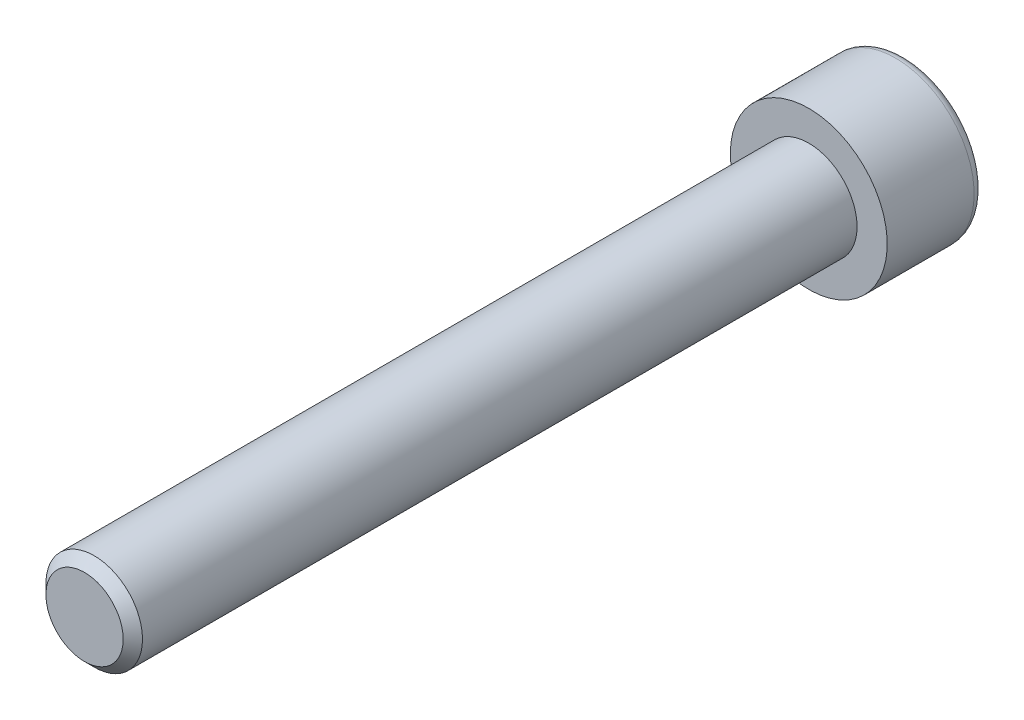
ISO-10303-21;
HEADER;
FILE_DESCRIPTION(('STEP AP214'),'2;1');
FILE_NAME('part.step','',(''),(''),'','','');
FILE_SCHEMA(('AUTOMOTIVE_DESIGN { 1 0 10303 214 1 1 1 1 }'));
ENDSEC;
DATA;
#1=APPLICATION_CONTEXT('core data for automotive mechanical design processes');
#2=APPLICATION_PROTOCOL_DEFINITION('international standard','automotive_design',2000,#1);
#3=PRODUCT_CONTEXT('',#1,'mechanical');
#4=PRODUCT('Part','Part','',(#3));
#5=PRODUCT_RELATED_PRODUCT_CATEGORY('part','',(#4));
#6=PRODUCT_DEFINITION_FORMATION('','',#4);
#7=PRODUCT_DEFINITION_CONTEXT('part definition',#1,'design');
#8=PRODUCT_DEFINITION('design','',#6,#7);
#9=PRODUCT_DEFINITION_SHAPE('','',#8);
#10=(LENGTH_UNIT() NAMED_UNIT(*) SI_UNIT(.MILLI.,.METRE.));
#11=(NAMED_UNIT(*) PLANE_ANGLE_UNIT() SI_UNIT($,.RADIAN.));
#12=(NAMED_UNIT(*) SI_UNIT($,.STERADIAN.) SOLID_ANGLE_UNIT());
#13=UNCERTAINTY_MEASURE_WITH_UNIT(LENGTH_MEASURE(1.E-05),#10,'distance_accuracy_value','');
#14=(GEOMETRIC_REPRESENTATION_CONTEXT(3) GLOBAL_UNCERTAINTY_ASSIGNED_CONTEXT((#13)) GLOBAL_UNIT_ASSIGNED_CONTEXT((#10,
#11,#12)) REPRESENTATION_CONTEXT('',''));
#15=CARTESIAN_POINT('',(0.,0.,0.));
#16=DIRECTION('',(0.,0.,1.));
#17=DIRECTION('',(1.,0.,0.));
#18=AXIS2_PLACEMENT_3D('',#15,#16,#17);
#19=CARTESIAN_POINT('',(0.,0.,-8.));
#20=DIRECTION('',(0.,0.,1.));
#21=DIRECTION('',(1.,0.,0.));
#22=AXIS2_PLACEMENT_3D('',#19,#20,#21);
#23=PLANE('',#22);
#24=CARTESIAN_POINT('',(0.,0.,-8.));
#25=DIRECTION('',(0.,0.,-1.));
#26=DIRECTION('',(-1.,0.,0.));
#27=AXIS2_PLACEMENT_3D('',#24,#25,#26);
#28=CIRCLE('',#27,5.7);
#29=CARTESIAN_POINT('',(-5.7,0.,-8.));
#30=VERTEX_POINT('',#29);
#31=EDGE_CURVE('E140',#30,#30,#28,.T.);
#32=ORIENTED_EDGE('',*,*,#31,.T.);
#33=EDGE_LOOP('',(#32));
#34=FACE_BOUND('',#33,.T.);
#35=DIRECTION('',(-0.86602540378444,0.499999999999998,0.));
#36=VECTOR('',#35,1.);
#37=CARTESIAN_POINT('',(0.,3.46410161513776,-8.));
#38=LINE('',#37,#36);
#39=CARTESIAN_POINT('',(3.,1.73205080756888,-8.));
#40=VERTEX_POINT('',#39);
#41=CARTESIAN_POINT('',(0.,3.46410161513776,-8.));
#42=VERTEX_POINT('',#41);
#43=EDGE_CURVE('E44',#40,#42,#38,.T.);
#44=ORIENTED_EDGE('',*,*,#43,.T.);
#45=DIRECTION('',(-0.866025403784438,-0.500000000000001,0.));
#46=VECTOR('',#45,1.);
#47=CARTESIAN_POINT('',(0.,3.46410161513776,-8.));
#48=LINE('',#47,#46);
#49=CARTESIAN_POINT('',(-3.,1.73205080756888,-8.));
#50=VERTEX_POINT('',#49);
#51=EDGE_CURVE('E84',#42,#50,#48,.T.);
#52=ORIENTED_EDGE('',*,*,#51,.T.);
#53=DIRECTION('',(0.,-1.,0.));
#54=VECTOR('',#53,1.);
#55=CARTESIAN_POINT('',(-3.,-1.73205080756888,-8.));
#56=LINE('',#55,#54);
#57=CARTESIAN_POINT('',(-3.,-1.73205080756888,-8.));
#58=VERTEX_POINT('',#57);
#59=EDGE_CURVE('E92',#50,#58,#56,.T.);
#60=ORIENTED_EDGE('',*,*,#59,.T.);
#61=DIRECTION('',(0.866025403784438,-0.500000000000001,0.));
#62=VECTOR('',#61,1.);
#63=CARTESIAN_POINT('',(0.,-3.46410161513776,-8.));
#64=LINE('',#63,#62);
#65=CARTESIAN_POINT('',(0.,-3.46410161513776,-8.));
#66=VERTEX_POINT('',#65);
#67=EDGE_CURVE('E110',#58,#66,#64,.T.);
#68=ORIENTED_EDGE('',*,*,#67,.T.);
#69=DIRECTION('',(0.86602540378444,0.499999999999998,0.));
#70=VECTOR('',#69,1.);
#71=CARTESIAN_POINT('',(0.,-3.46410161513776,-8.));
#72=LINE('',#71,#70);
#73=CARTESIAN_POINT('',(3.,-1.73205080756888,-8.));
#74=VERTEX_POINT('',#73);
#75=EDGE_CURVE('E113',#66,#74,#72,.T.);
#76=ORIENTED_EDGE('',*,*,#75,.T.);
#77=DIRECTION('',(0.,1.,0.));
#78=VECTOR('',#77,1.);
#79=CARTESIAN_POINT('',(3.,-1.73205080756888,-8.));
#80=LINE('',#79,#78);
#81=EDGE_CURVE('E103',#74,#40,#80,.T.);
#82=ORIENTED_EDGE('',*,*,#81,.T.);
#83=EDGE_LOOP('',(#44,#52,#60,#68,#76,#82));
#84=FACE_BOUND('',#83,.T.);
#85=ADVANCED_FACE('F30',(#34,#84),#23,.F.);
#86=CARTESIAN_POINT('',(0.,0.,-7.2));
#87=DIRECTION('',(0.,0.,-1.));
#88=DIRECTION('',(-1.,0.,0.));
#89=AXIS2_PLACEMENT_3D('',#86,#87,#88);
#90=TOROIDAL_SURFACE('',#89,5.7,0.8);
#91=ORIENTED_EDGE('',*,*,#31,.F.);
#92=EDGE_LOOP('',(#91));
#93=FACE_BOUND('',#92,.T.);
#94=CARTESIAN_POINT('',(0.,0.,-7.2));
#95=DIRECTION('',(0.,0.,-1.));
#96=DIRECTION('',(-1.,0.,0.));
#97=AXIS2_PLACEMENT_3D('',#94,#95,#96);
#98=CIRCLE('',#97,6.5);
#99=CARTESIAN_POINT('',(-6.5,0.,-7.2));
#100=VERTEX_POINT('',#99);
#101=EDGE_CURVE('E137',#100,#100,#98,.T.);
#102=ORIENTED_EDGE('',*,*,#101,.T.);
#103=EDGE_LOOP('',(#102));
#104=FACE_BOUND('',#103,.T.);
#105=ADVANCED_FACE('F159',(#93,#104),#90,.T.);
#106=CARTESIAN_POINT('',(0.,0.,0.));
#107=DIRECTION('',(0.,0.,-1.));
#108=DIRECTION('',(-1.,0.,0.));
#109=AXIS2_PLACEMENT_3D('',#106,#107,#108);
#110=CYLINDRICAL_SURFACE('',#109,6.5);
#111=ORIENTED_EDGE('',*,*,#101,.F.);
#112=EDGE_LOOP('',(#111));
#113=FACE_BOUND('',#112,.T.);
#114=CARTESIAN_POINT('',(0.,0.,0.));
#115=DIRECTION('',(0.,0.,-1.));
#116=DIRECTION('',(-1.,0.,0.));
#117=AXIS2_PLACEMENT_3D('',#114,#115,#116);
#118=CIRCLE('',#117,6.5);
#119=CARTESIAN_POINT('',(-6.5,0.,0.));
#120=VERTEX_POINT('',#119);
#121=EDGE_CURVE('E98',#120,#120,#118,.T.);
#122=ORIENTED_EDGE('',*,*,#121,.T.);
#123=EDGE_LOOP('',(#122));
#124=FACE_BOUND('',#123,.T.);
#125=ADVANCED_FACE('F164',(#113,#124),#110,.T.);
#126=CARTESIAN_POINT('',(0.,0.,0.));
#127=DIRECTION('',(0.,0.,-1.));
#128=DIRECTION('',(-1.,0.,0.));
#129=AXIS2_PLACEMENT_3D('',#126,#127,#128);
#130=PLANE('',#129);
#131=CARTESIAN_POINT('',(0.,0.,0.));
#132=DIRECTION('',(0.,0.,1.));
#133=DIRECTION('',(1.,0.,0.));
#134=AXIS2_PLACEMENT_3D('',#131,#132,#133);
#135=CIRCLE('',#134,4.);
#136=CARTESIAN_POINT('',(4.,0.,0.));
#137=VERTEX_POINT('',#136);
#138=EDGE_CURVE('E104',#137,#137,#135,.T.);
#139=ORIENTED_EDGE('',*,*,#138,.F.);
#140=EDGE_LOOP('',(#139));
#141=FACE_BOUND('',#140,.T.);
#142=ORIENTED_EDGE('',*,*,#121,.F.);
#143=EDGE_LOOP('',(#142));
#144=FACE_BOUND('',#143,.T.);
#145=ADVANCED_FACE('F172',(#141,#144),#130,.F.);
#146=CARTESIAN_POINT('',(0.,3.46410161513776,-4.));
#147=DIRECTION('',(-0.499999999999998,-0.86602540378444,0.));
#148=DIRECTION('',(0.86602540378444,-0.499999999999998,0.));
#149=AXIS2_PLACEMENT_3D('',#146,#147,#148);
#150=PLANE('',#149);
#151=ORIENTED_EDGE('',*,*,#43,.F.);
#152=DIRECTION('',(0.,0.,-1.));
#153=VECTOR('',#152,1.);
#154=CARTESIAN_POINT('',(3.,1.73205080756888,-4.));
#155=LINE('',#154,#153);
#156=CARTESIAN_POINT('',(3.,1.73205080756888,-4.));
#157=VERTEX_POINT('',#156);
#158=EDGE_CURVE('E126',#157,#40,#155,.T.);
#159=ORIENTED_EDGE('',*,*,#158,.F.);
#160=DIRECTION('',(-0.86602540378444,0.499999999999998,0.));
#161=VECTOR('',#160,1.);
#162=CARTESIAN_POINT('',(0.,3.46410161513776,-4.));
#163=LINE('',#162,#161);
#164=CARTESIAN_POINT('',(0.,3.46410161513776,-4.));
#165=VERTEX_POINT('',#164);
#166=EDGE_CURVE('E97',#157,#165,#163,.T.);
#167=ORIENTED_EDGE('',*,*,#166,.T.);
#168=DIRECTION('',(0.,0.,-1.));
#169=VECTOR('',#168,1.);
#170=CARTESIAN_POINT('',(0.,3.46410161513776,-4.));
#171=LINE('',#170,#169);
#172=EDGE_CURVE('E86',#165,#42,#171,.T.);
#173=ORIENTED_EDGE('',*,*,#172,.T.);
#174=EDGE_LOOP('',(#151,#159,#167,#173));
#175=FACE_BOUND('',#174,.T.);
#176=ADVANCED_FACE('F95',(#175),#150,.T.);
#177=CARTESIAN_POINT('',(0.,3.46410161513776,-4.));
#178=DIRECTION('',(0.500000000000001,-0.866025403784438,0.));
#179=DIRECTION('',(0.866025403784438,0.500000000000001,0.));
#180=AXIS2_PLACEMENT_3D('',#177,#178,#179);
#181=PLANE('',#180);
#182=ORIENTED_EDGE('',*,*,#51,.F.);
#183=ORIENTED_EDGE('',*,*,#172,.F.);
#184=DIRECTION('',(-0.866025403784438,-0.500000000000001,0.));
#185=VECTOR('',#184,1.);
#186=CARTESIAN_POINT('',(0.,3.46410161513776,-4.));
#187=LINE('',#186,#185);
#188=CARTESIAN_POINT('',(-3.,1.73205080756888,-4.));
#189=VERTEX_POINT('',#188);
#190=EDGE_CURVE('E117',#165,#189,#187,.T.);
#191=ORIENTED_EDGE('',*,*,#190,.T.);
#192=DIRECTION('',(0.,0.,-1.));
#193=VECTOR('',#192,1.);
#194=CARTESIAN_POINT('',(-3.,1.73205080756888,-4.));
#195=LINE('',#194,#193);
#196=EDGE_CURVE('E88',#189,#50,#195,.T.);
#197=ORIENTED_EDGE('',*,*,#196,.T.);
#198=EDGE_LOOP('',(#182,#183,#191,#197));
#199=FACE_BOUND('',#198,.T.);
#200=ADVANCED_FACE('F85',(#199),#181,.T.);
#201=CARTESIAN_POINT('',(-3.,-1.73205080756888,-4.));
#202=DIRECTION('',(1.,0.,0.));
#203=DIRECTION('',(0.,0.,-1.));
#204=AXIS2_PLACEMENT_3D('',#201,#202,#203);
#205=PLANE('',#204);
#206=ORIENTED_EDGE('',*,*,#59,.F.);
#207=ORIENTED_EDGE('',*,*,#196,.F.);
#208=DIRECTION('',(0.,-1.,0.));
#209=VECTOR('',#208,1.);
#210=CARTESIAN_POINT('',(-3.,-1.73205080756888,-4.));
#211=LINE('',#210,#209);
#212=CARTESIAN_POINT('',(-3.,-1.73205080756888,-4.));
#213=VERTEX_POINT('',#212);
#214=EDGE_CURVE('E119',#189,#213,#211,.T.);
#215=ORIENTED_EDGE('',*,*,#214,.T.);
#216=DIRECTION('',(0.,0.,-1.));
#217=VECTOR('',#216,1.);
#218=CARTESIAN_POINT('',(-3.,-1.73205080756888,-4.));
#219=LINE('',#218,#217);
#220=EDGE_CURVE('E132',#213,#58,#219,.T.);
#221=ORIENTED_EDGE('',*,*,#220,.T.);
#222=EDGE_LOOP('',(#206,#207,#215,#221));
#223=FACE_BOUND('',#222,.T.);
#224=ADVANCED_FACE('F187',(#223),#205,.T.);
#225=CARTESIAN_POINT('',(0.,-3.46410161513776,-4.));
#226=DIRECTION('',(0.500000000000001,0.866025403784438,0.));
#227=DIRECTION('',(-0.866025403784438,0.500000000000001,0.));
#228=AXIS2_PLACEMENT_3D('',#225,#226,#227);
#229=PLANE('',#228);
#230=ORIENTED_EDGE('',*,*,#67,.F.);
#231=ORIENTED_EDGE('',*,*,#220,.F.);
#232=DIRECTION('',(0.866025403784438,-0.500000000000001,0.));
#233=VECTOR('',#232,1.);
#234=CARTESIAN_POINT('',(0.,-3.46410161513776,-4.));
#235=LINE('',#234,#233);
#236=CARTESIAN_POINT('',(0.,-3.46410161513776,-4.));
#237=VERTEX_POINT('',#236);
#238=EDGE_CURVE('E121',#213,#237,#235,.T.);
#239=ORIENTED_EDGE('',*,*,#238,.T.);
#240=DIRECTION('',(0.,0.,-1.));
#241=VECTOR('',#240,1.);
#242=CARTESIAN_POINT('',(0.,-3.46410161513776,-4.));
#243=LINE('',#242,#241);
#244=EDGE_CURVE('E130',#237,#66,#243,.T.);
#245=ORIENTED_EDGE('',*,*,#244,.T.);
#246=EDGE_LOOP('',(#230,#231,#239,#245));
#247=FACE_BOUND('',#246,.T.);
#248=ADVANCED_FACE('F190',(#247),#229,.T.);
#249=CARTESIAN_POINT('',(0.,-3.46410161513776,-4.));
#250=DIRECTION('',(-0.499999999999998,0.86602540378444,0.));
#251=DIRECTION('',(-0.86602540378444,-0.499999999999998,0.));
#252=AXIS2_PLACEMENT_3D('',#249,#250,#251);
#253=PLANE('',#252);
#254=ORIENTED_EDGE('',*,*,#75,.F.);
#255=ORIENTED_EDGE('',*,*,#244,.F.);
#256=DIRECTION('',(0.86602540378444,0.499999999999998,0.));
#257=VECTOR('',#256,1.);
#258=CARTESIAN_POINT('',(0.,-3.46410161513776,-4.));
#259=LINE('',#258,#257);
#260=CARTESIAN_POINT('',(3.,-1.73205080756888,-4.));
#261=VERTEX_POINT('',#260);
#262=EDGE_CURVE('E123',#237,#261,#259,.T.);
#263=ORIENTED_EDGE('',*,*,#262,.T.);
#264=DIRECTION('',(0.,0.,-1.));
#265=VECTOR('',#264,1.);
#266=CARTESIAN_POINT('',(3.,-1.73205080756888,-4.));
#267=LINE('',#266,#265);
#268=EDGE_CURVE('E128',#261,#74,#267,.T.);
#269=ORIENTED_EDGE('',*,*,#268,.T.);
#270=EDGE_LOOP('',(#254,#255,#263,#269));
#271=FACE_BOUND('',#270,.T.);
#272=ADVANCED_FACE('F194',(#271),#253,.T.);
#273=CARTESIAN_POINT('',(3.,-1.73205080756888,-4.));
#274=DIRECTION('',(-1.,0.,0.));
#275=DIRECTION('',(0.,0.,1.));
#276=AXIS2_PLACEMENT_3D('',#273,#274,#275);
#277=PLANE('',#276);
#278=ORIENTED_EDGE('',*,*,#81,.F.);
#279=ORIENTED_EDGE('',*,*,#268,.F.);
#280=DIRECTION('',(0.,1.,0.));
#281=VECTOR('',#280,1.);
#282=CARTESIAN_POINT('',(3.,-1.73205080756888,-4.));
#283=LINE('',#282,#281);
#284=EDGE_CURVE('E51',#261,#157,#283,.T.);
#285=ORIENTED_EDGE('',*,*,#284,.T.);
#286=ORIENTED_EDGE('',*,*,#158,.T.);
#287=EDGE_LOOP('',(#278,#279,#285,#286));
#288=FACE_BOUND('',#287,.T.);
#289=ADVANCED_FACE('F198',(#288),#277,.T.);
#290=CARTESIAN_POINT('',(3.,1.73205080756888,-4.));
#291=DIRECTION('',(0.,0.,1.));
#292=DIRECTION('',(1.,0.,0.));
#293=AXIS2_PLACEMENT_3D('',#290,#291,#292);
#294=PLANE('',#293);
#295=ORIENTED_EDGE('',*,*,#166,.F.);
#296=ORIENTED_EDGE('',*,*,#284,.F.);
#297=ORIENTED_EDGE('',*,*,#262,.F.);
#298=ORIENTED_EDGE('',*,*,#238,.F.);
#299=ORIENTED_EDGE('',*,*,#214,.F.);
#300=ORIENTED_EDGE('',*,*,#190,.F.);
#301=EDGE_LOOP('',(#295,#296,#297,#298,#299,#300));
#302=FACE_BOUND('',#301,.T.);
#303=ADVANCED_FACE('F202',(#302),#294,.F.);
#304=CARTESIAN_POINT('',(0.,0.,60.));
#305=DIRECTION('',(0.,0.,1.));
#306=DIRECTION('',(1.,0.,0.));
#307=AXIS2_PLACEMENT_3D('',#304,#305,#306);
#308=PLANE('',#307);
#309=CARTESIAN_POINT('',(0.,0.,60.));
#310=DIRECTION('',(0.,0.,1.));
#311=DIRECTION('',(1.,0.,0.));
#312=AXIS2_PLACEMENT_3D('',#309,#310,#311);
#313=CIRCLE('',#312,3.19999999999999);
#314=CARTESIAN_POINT('',(3.19999999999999,0.,60.));
#315=VERTEX_POINT('',#314);
#316=EDGE_CURVE('E37',#315,#315,#313,.T.);
#317=ORIENTED_EDGE('',*,*,#316,.T.);
#318=EDGE_LOOP('',(#317));
#319=FACE_BOUND('',#318,.T.);
#320=ADVANCED_FACE('F145',(#319),#308,.T.);
#321=CARTESIAN_POINT('',(0.,0.,0.));
#322=DIRECTION('',(0.,0.,1.));
#323=DIRECTION('',(1.,0.,0.));
#324=AXIS2_PLACEMENT_3D('',#321,#322,#323);
#325=CYLINDRICAL_SURFACE('',#324,4.);
#326=CARTESIAN_POINT('',(0.,0.,59.2));
#327=DIRECTION('',(0.,0.,1.));
#328=DIRECTION('',(1.,0.,0.));
#329=AXIS2_PLACEMENT_3D('',#326,#327,#328);
#330=CIRCLE('',#329,4.);
#331=CARTESIAN_POINT('',(4.00000000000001,0.,59.2));
#332=VERTEX_POINT('',#331);
#333=EDGE_CURVE('E11',#332,#332,#330,.F.);
#334=ORIENTED_EDGE('',*,*,#333,.T.);
#335=EDGE_LOOP('',(#334));
#336=FACE_BOUND('',#335,.T.);
#337=ORIENTED_EDGE('',*,*,#138,.T.);
#338=EDGE_LOOP('',(#337));
#339=FACE_BOUND('',#338,.T.);
#340=ADVANCED_FACE('F149',(#336,#339),#325,.T.);
#341=CARTESIAN_POINT('',(0.,0.,60.));
#342=DIRECTION('',(0.,0.,-1.));
#343=DIRECTION('',(-1.,0.,0.));
#344=AXIS2_PLACEMENT_3D('',#341,#342,#343);
#345=CONICAL_SURFACE('',#344,3.19999999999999,0.785398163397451);
#346=ORIENTED_EDGE('',*,*,#333,.F.);
#347=EDGE_LOOP('',(#346));
#348=FACE_BOUND('',#347,.T.);
#349=ORIENTED_EDGE('',*,*,#316,.F.);
#350=EDGE_LOOP('',(#349));
#351=FACE_BOUND('',#350,.T.);
#352=ADVANCED_FACE('F147',(#348,#351),#345,.T.);
#353=CLOSED_SHELL('',(#85,#105,#125,#145,#176,#200,#224,#248,#272,#289,#303,#320,#340,#352));
#354=MANIFOLD_SOLID_BREP('B2',#353);
#355=ADVANCED_BREP_SHAPE_REPRESENTATION('',(#18,#354),#14);
#356=SHAPE_DEFINITION_REPRESENTATION(#9,#355);
ENDSEC;
END-ISO-10303-21;
